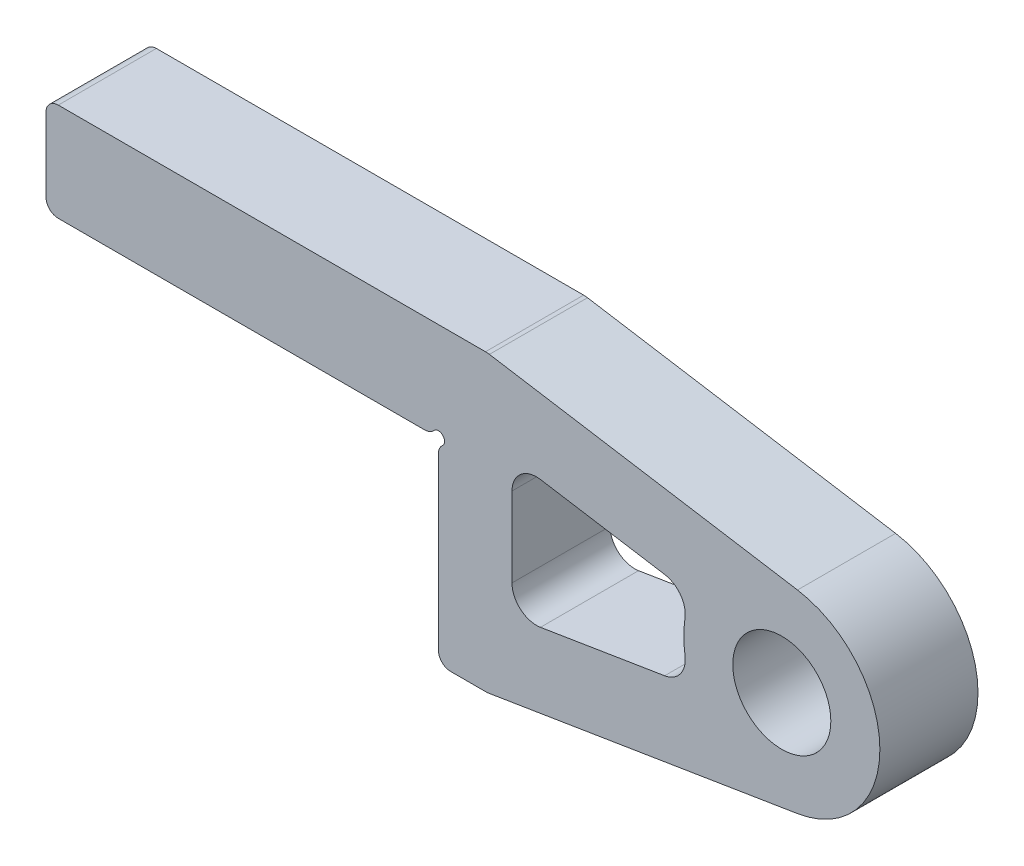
ISO-10303-21;
HEADER;
FILE_DESCRIPTION(('STEP AP214'),'2;1');
FILE_NAME('part.step','',(''),(''),'','','');
FILE_SCHEMA(('AUTOMOTIVE_DESIGN { 1 0 10303 214 1 1 1 1 }'));
ENDSEC;
DATA;
#1=APPLICATION_CONTEXT('core data for automotive mechanical design processes');
#2=APPLICATION_PROTOCOL_DEFINITION('international standard','automotive_design',2000,#1);
#3=PRODUCT_CONTEXT('',#1,'mechanical');
#4=PRODUCT('Part','Part','',(#3));
#5=PRODUCT_RELATED_PRODUCT_CATEGORY('part','',(#4));
#6=PRODUCT_DEFINITION_FORMATION('','',#4);
#7=PRODUCT_DEFINITION_CONTEXT('part definition',#1,'design');
#8=PRODUCT_DEFINITION('design','',#6,#7);
#9=PRODUCT_DEFINITION_SHAPE('','',#8);
#10=(LENGTH_UNIT() NAMED_UNIT(*) SI_UNIT(.MILLI.,.METRE.));
#11=(NAMED_UNIT(*) PLANE_ANGLE_UNIT() SI_UNIT($,.RADIAN.));
#12=(NAMED_UNIT(*) SI_UNIT($,.STERADIAN.) SOLID_ANGLE_UNIT());
#13=UNCERTAINTY_MEASURE_WITH_UNIT(LENGTH_MEASURE(1.E-05),#10,'distance_accuracy_value','');
#14=(GEOMETRIC_REPRESENTATION_CONTEXT(3) GLOBAL_UNCERTAINTY_ASSIGNED_CONTEXT((#13)) GLOBAL_UNIT_ASSIGNED_CONTEXT((#10,
#11,#12)) REPRESENTATION_CONTEXT('',''));
#15=CARTESIAN_POINT('',(0.,0.,0.));
#16=DIRECTION('',(0.,0.,1.));
#17=DIRECTION('',(1.,0.,0.));
#18=AXIS2_PLACEMENT_3D('',#15,#16,#17);
#19=CARTESIAN_POINT('',(0.,0.,6.35));
#20=DIRECTION('',(0.,0.,-1.));
#21=DIRECTION('',(-1.,0.,0.));
#22=AXIS2_PLACEMENT_3D('',#19,#20,#21);
#23=PLANE('',#22);
#24=DIRECTION('',(1.,0.,0.));
#25=VECTOR('',#24,1.);
#26=CARTESIAN_POINT('',(-25.4,-6.35,6.35));
#27=LINE('',#26,#25);
#28=CARTESIAN_POINT('',(-23.8125,-6.35,6.35));
#29=VERTEX_POINT('',#28);
#30=CARTESIAN_POINT('',(23.6251210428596,-6.35,6.35));
#31=VERTEX_POINT('',#30);
#32=EDGE_CURVE('E415',#29,#31,#27,.T.);
#33=ORIENTED_EDGE('',*,*,#32,.T.);
#34=CARTESIAN_POINT('',(23.6251210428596,-4.7625,6.35));
#35=DIRECTION('',(0.,0.,-1.));
#36=DIRECTION('',(-1.,0.,0.));
#37=AXIS2_PLACEMENT_3D('',#34,#35,#36);
#38=CIRCLE('',#37,1.5875);
#39=CARTESIAN_POINT('',(24.8083736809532,-5.82083333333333,6.35));
#40=VERTEX_POINT('',#39);
#41=EDGE_CURVE('E484',#31,#40,#38,.F.);
#42=ORIENTED_EDGE('',*,*,#41,.T.);
#43=CARTESIAN_POINT('',(25.4,-6.35,6.35));
#44=DIRECTION('',(0.,0.,1.));
#45=DIRECTION('',(1.,0.,0.));
#46=AXIS2_PLACEMENT_3D('',#43,#44,#45);
#47=CIRCLE('',#46,0.79375);
#48=CARTESIAN_POINT('',(25.9291666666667,-6.94162631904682,6.35));
#49=VERTEX_POINT('',#48);
#50=EDGE_CURVE('E309',#49,#40,#47,.T.);
#51=ORIENTED_EDGE('',*,*,#50,.F.);
#52=CARTESIAN_POINT('',(26.9875,-8.12487895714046,6.35));
#53=DIRECTION('',(0.,0.,-1.));
#54=DIRECTION('',(-1.,0.,0.));
#55=AXIS2_PLACEMENT_3D('',#52,#53,#54);
#56=CIRCLE('',#55,1.5875);
#57=CARTESIAN_POINT('',(25.4,-8.12487895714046,6.35));
#58=VERTEX_POINT('',#57);
#59=EDGE_CURVE('E482',#49,#58,#56,.F.);
#60=ORIENTED_EDGE('',*,*,#59,.T.);
#61=DIRECTION('',(0.,-1.,0.));
#62=VECTOR('',#61,1.);
#63=CARTESIAN_POINT('',(25.4,-6.35,6.35));
#64=LINE('',#63,#62);
#65=CARTESIAN_POINT('',(25.4,-30.1625,6.35));
#66=VERTEX_POINT('',#65);
#67=EDGE_CURVE('E418',#58,#66,#64,.T.);
#68=ORIENTED_EDGE('',*,*,#67,.T.);
#69=CARTESIAN_POINT('',(26.9875,-30.1625,6.35));
#70=DIRECTION('',(0.,0.,-1.));
#71=DIRECTION('',(-1.,0.,0.));
#72=AXIS2_PLACEMENT_3D('',#69,#70,#71);
#73=CIRCLE('',#72,1.5875);
#74=CARTESIAN_POINT('',(26.9875,-31.75,6.35));
#75=VERTEX_POINT('',#74);
#76=EDGE_CURVE('E467',#66,#75,#73,.F.);
#77=ORIENTED_EDGE('',*,*,#76,.T.);
#78=DIRECTION('',(1.,0.,0.));
#79=VECTOR('',#78,1.);
#80=CARTESIAN_POINT('',(25.4,-31.75,6.35));
#81=LINE('',#80,#79);
#82=CARTESIAN_POINT('',(31.4940161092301,-31.75,6.35));
#83=VERTEX_POINT('',#82);
#84=EDGE_CURVE('E420',#75,#83,#81,.T.);
#85=ORIENTED_EDGE('',*,*,#84,.T.);
#86=CARTESIAN_POINT('',(31.4940161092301,-28.575,6.35));
#87=DIRECTION('',(0.,0.,1.));
#88=DIRECTION('',(1.,0.,0.));
#89=AXIS2_PLACEMENT_3D('',#86,#87,#88);
#90=CIRCLE('',#89,3.175);
#91=CARTESIAN_POINT('',(32.0026774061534,-31.7089892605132,6.35));
#92=VERTEX_POINT('',#91);
#93=EDGE_CURVE('E348',#83,#92,#90,.T.);
#94=ORIENTED_EDGE('',*,*,#93,.T.);
#95=DIRECTION('',(0.987083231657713,0.160208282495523,0.));
#96=VECTOR('',#95,1.);
#97=CARTESIAN_POINT('',(5.83582789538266,-35.9559928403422,6.35));
#98=LINE('',#97,#96);
#99=CARTESIAN_POINT('',(71.8846451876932,-25.235957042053,6.35));
#100=VERTEX_POINT('',#99);
#101=EDGE_CURVE('E366',#92,#100,#98,.T.);
#102=ORIENTED_EDGE('',*,*,#101,.T.);
#103=CARTESIAN_POINT('',(69.85,-12.7,6.35));
#104=DIRECTION('',(0.,0.,1.));
#105=DIRECTION('',(1.,0.,0.));
#106=AXIS2_PLACEMENT_3D('',#103,#104,#105);
#107=CIRCLE('',#106,12.7);
#108=CARTESIAN_POINT('',(71.8846451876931,-0.164042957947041,6.35));
#109=VERTEX_POINT('',#108);
#110=EDGE_CURVE('E363',#100,#109,#107,.T.);
#111=ORIENTED_EDGE('',*,*,#110,.T.);
#112=DIRECTION('',(0.987083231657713,-0.160208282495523,0.));
#113=VECTOR('',#112,1.);
#114=CARTESIAN_POINT('',(1.81909960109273,11.2079268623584,6.35));
#115=LINE('',#114,#113);
#116=CARTESIAN_POINT('',(32.0026774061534,6.30898926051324,6.35));
#117=VERTEX_POINT('',#116);
#118=EDGE_CURVE('E360',#117,#109,#115,.T.);
#119=ORIENTED_EDGE('',*,*,#118,.F.);
#120=CARTESIAN_POINT('',(31.4940161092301,3.175,6.35));
#121=DIRECTION('',(0.,0.,1.));
#122=DIRECTION('',(1.,0.,0.));
#123=AXIS2_PLACEMENT_3D('',#120,#121,#122);
#124=CIRCLE('',#123,3.175);
#125=CARTESIAN_POINT('',(31.4940161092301,6.35,6.35));
#126=VERTEX_POINT('',#125);
#127=EDGE_CURVE('E341',#126,#117,#124,.F.);
#128=ORIENTED_EDGE('',*,*,#127,.F.);
#129=DIRECTION('',(-1.,0.,0.));
#130=VECTOR('',#129,1.);
#131=CARTESIAN_POINT('',(25.4,6.35,6.35));
#132=LINE('',#131,#130);
#133=CARTESIAN_POINT('',(-23.8125,6.35,6.35));
#134=VERTEX_POINT('',#133);
#135=EDGE_CURVE('E408',#126,#134,#132,.T.);
#136=ORIENTED_EDGE('',*,*,#135,.T.);
#137=CARTESIAN_POINT('',(-23.8125,4.7625,6.35));
#138=DIRECTION('',(0.,0.,-1.));
#139=DIRECTION('',(-1.,0.,0.));
#140=AXIS2_PLACEMENT_3D('',#137,#138,#139);
#141=CIRCLE('',#140,1.5875);
#142=CARTESIAN_POINT('',(-25.4,4.7625,6.35));
#143=VERTEX_POINT('',#142);
#144=EDGE_CURVE('E463',#134,#143,#141,.F.);
#145=ORIENTED_EDGE('',*,*,#144,.T.);
#146=DIRECTION('',(0.,-1.,0.));
#147=VECTOR('',#146,1.);
#148=CARTESIAN_POINT('',(-25.4,-6.35,6.35));
#149=LINE('',#148,#147);
#150=CARTESIAN_POINT('',(-25.4,-4.7625,6.35));
#151=VERTEX_POINT('',#150);
#152=EDGE_CURVE('E411',#143,#151,#149,.T.);
#153=ORIENTED_EDGE('',*,*,#152,.T.);
#154=CARTESIAN_POINT('',(-23.8125,-4.7625,6.35));
#155=DIRECTION('',(0.,0.,-1.));
#156=DIRECTION('',(-1.,0.,0.));
#157=AXIS2_PLACEMENT_3D('',#154,#155,#156);
#158=CIRCLE('',#157,1.5875);
#159=EDGE_CURVE('E465',#151,#29,#158,.F.);
#160=ORIENTED_EDGE('',*,*,#159,.T.);
#161=EDGE_LOOP('',(#33,#42,#51,#60,#68,#77,#85,#94,#102,#111,#119,#128,#136,#145,#153,#160));
#162=FACE_BOUND('',#161,.T.);
#163=CARTESIAN_POINT('',(69.85,-12.7,6.35));
#164=DIRECTION('',(0.,0.,1.));
#165=DIRECTION('',(1.,0.,0.));
#166=AXIS2_PLACEMENT_3D('',#163,#164,#165);
#167=CIRCLE('',#166,6.35);
#168=CARTESIAN_POINT('',(76.2,-12.7,6.35));
#169=VERTEX_POINT('',#168);
#170=EDGE_CURVE('E334',#169,#169,#167,.T.);
#171=ORIENTED_EDGE('',*,*,#170,.F.);
#172=EDGE_LOOP('',(#171));
#173=FACE_BOUND('',#172,.T.);
#174=CARTESIAN_POINT('',(38.1,-17.8531753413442,6.35));
#175=DIRECTION('',(0.,0.,1.));
#176=DIRECTION('',(1.,0.,0.));
#177=AXIS2_PLACEMENT_3D('',#174,#175,#176);
#178=CIRCLE('',#177,3.175);
#179=CARTESIAN_POINT('',(38.6086612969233,-20.9871646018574,6.35));
#180=VERTEX_POINT('',#179);
#181=CARTESIAN_POINT('',(34.925,-17.8531753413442,6.35));
#182=VERTEX_POINT('',#181);
#183=EDGE_CURVE('E283',#180,#182,#178,.F.);
#184=ORIENTED_EDGE('',*,*,#183,.T.);
#185=DIRECTION('',(0.,-1.,0.));
#186=VECTOR('',#185,1.);
#187=CARTESIAN_POINT('',(34.925,0.,6.35));
#188=LINE('',#187,#186);
#189=CARTESIAN_POINT('',(34.925,-7.54682465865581,6.35));
#190=VERTEX_POINT('',#189);
#191=EDGE_CURVE('E303',#190,#182,#188,.T.);
#192=ORIENTED_EDGE('',*,*,#191,.F.);
#193=CARTESIAN_POINT('',(38.1,-7.54682465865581,6.35));
#194=DIRECTION('',(0.,0.,1.));
#195=DIRECTION('',(1.,0.,0.));
#196=AXIS2_PLACEMENT_3D('',#193,#194,#195);
#197=CIRCLE('',#196,3.175);
#198=CARTESIAN_POINT('',(38.6086612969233,-4.41283539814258,6.35));
#199=VERTEX_POINT('',#198);
#200=EDGE_CURVE('E306',#199,#190,#197,.T.);
#201=ORIENTED_EDGE('',*,*,#200,.F.);
#202=DIRECTION('',(0.987083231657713,-0.160208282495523,0.));
#203=VECTOR('',#202,1.);
#204=CARTESIAN_POINT('',(0.293115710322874,1.80595908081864,6.35));
#205=LINE('',#204,#203);
#206=CARTESIAN_POINT('',(54.6887149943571,-7.02270425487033,6.35));
#207=VERTEX_POINT('',#206);
#208=EDGE_CURVE('E327',#199,#207,#205,.T.);
#209=ORIENTED_EDGE('',*,*,#208,.T.);
#210=CARTESIAN_POINT('',(54.1800536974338,-10.1566935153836,6.35));
#211=DIRECTION('',(0.,0.,-1.));
#212=DIRECTION('',(-1.,0.,0.));
#213=AXIS2_PLACEMENT_3D('',#210,#211,#212);
#214=CIRCLE('',#213,3.175);
#215=CARTESIAN_POINT('',(57.314042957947,-10.6653548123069,6.35));
#216=VERTEX_POINT('',#215);
#217=EDGE_CURVE('E446',#207,#216,#214,.T.);
#218=ORIENTED_EDGE('',*,*,#217,.T.);
#219=CARTESIAN_POINT('',(69.85,-12.7,6.35));
#220=DIRECTION('',(0.,0.,1.));
#221=DIRECTION('',(1.,0.,0.));
#222=AXIS2_PLACEMENT_3D('',#219,#220,#221);
#223=CIRCLE('',#222,12.7);
#224=CARTESIAN_POINT('',(57.314042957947,-14.7346451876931,6.35));
#225=VERTEX_POINT('',#224);
#226=EDGE_CURVE('E324',#216,#225,#223,.T.);
#227=ORIENTED_EDGE('',*,*,#226,.T.);
#228=CARTESIAN_POINT('',(54.1800536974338,-15.2433064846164,6.35));
#229=DIRECTION('',(0.,0.,-1.));
#230=DIRECTION('',(-1.,0.,0.));
#231=AXIS2_PLACEMENT_3D('',#228,#229,#230);
#232=CIRCLE('',#231,3.175);
#233=CARTESIAN_POINT('',(54.6887149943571,-18.3772957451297,6.35));
#234=VERTEX_POINT('',#233);
#235=EDGE_CURVE('E442',#225,#234,#232,.T.);
#236=ORIENTED_EDGE('',*,*,#235,.T.);
#237=DIRECTION('',(0.987083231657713,0.160208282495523,0.));
#238=VECTOR('',#237,1.);
#239=CARTESIAN_POINT('',(4.3098440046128,-26.5540250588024,6.35));
#240=LINE('',#239,#238);
#241=EDGE_CURVE('E321',#180,#234,#240,.T.);
#242=ORIENTED_EDGE('',*,*,#241,.F.);
#243=EDGE_LOOP('',(#184,#192,#201,#209,#218,#227,#236,#242));
#244=FACE_BOUND('',#243,.T.);
#245=ADVANCED_FACE('F108',(#162,#173,#244),#23,.F.);
#246=CARTESIAN_POINT('',(0.,0.,-6.35));
#247=DIRECTION('',(0.,0.,-1.));
#248=DIRECTION('',(-1.,0.,0.));
#249=AXIS2_PLACEMENT_3D('',#246,#247,#248);
#250=PLANE('',#249);
#251=CARTESIAN_POINT('',(25.4,-6.35,-6.35));
#252=DIRECTION('',(0.,0.,1.));
#253=DIRECTION('',(1.,0.,0.));
#254=AXIS2_PLACEMENT_3D('',#251,#252,#253);
#255=CIRCLE('',#254,0.79375);
#256=CARTESIAN_POINT('',(25.9291666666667,-6.94162631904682,-6.35));
#257=VERTEX_POINT('',#256);
#258=CARTESIAN_POINT('',(24.8083736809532,-5.82083333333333,-6.35));
#259=VERTEX_POINT('',#258);
#260=EDGE_CURVE('E322',#257,#259,#255,.T.);
#261=ORIENTED_EDGE('',*,*,#260,.T.);
#262=CARTESIAN_POINT('',(23.6251210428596,-4.7625,-6.35));
#263=DIRECTION('',(0.,0.,-1.));
#264=DIRECTION('',(-1.,0.,0.));
#265=AXIS2_PLACEMENT_3D('',#262,#263,#264);
#266=CIRCLE('',#265,1.5875);
#267=CARTESIAN_POINT('',(23.6251210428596,-6.35,-6.35));
#268=VERTEX_POINT('',#267);
#269=EDGE_CURVE('E116',#259,#268,#266,.T.);
#270=ORIENTED_EDGE('',*,*,#269,.T.);
#271=DIRECTION('',(1.,0.,0.));
#272=VECTOR('',#271,1.);
#273=CARTESIAN_POINT('',(-25.4,-6.35,-6.35));
#274=LINE('',#273,#272);
#275=CARTESIAN_POINT('',(-23.8125,-6.35,-6.35));
#276=VERTEX_POINT('',#275);
#277=EDGE_CURVE('E428',#276,#268,#274,.T.);
#278=ORIENTED_EDGE('',*,*,#277,.F.);
#279=CARTESIAN_POINT('',(-23.8125,-4.7625,-6.35));
#280=DIRECTION('',(0.,0.,-1.));
#281=DIRECTION('',(-1.,0.,0.));
#282=AXIS2_PLACEMENT_3D('',#279,#280,#281);
#283=CIRCLE('',#282,1.5875);
#284=CARTESIAN_POINT('',(-25.4,-4.7625,-6.35));
#285=VERTEX_POINT('',#284);
#286=EDGE_CURVE('E455',#276,#285,#283,.T.);
#287=ORIENTED_EDGE('',*,*,#286,.T.);
#288=DIRECTION('',(0.,-1.,0.));
#289=VECTOR('',#288,1.);
#290=CARTESIAN_POINT('',(-25.4,-6.35,-6.35));
#291=LINE('',#290,#289);
#292=CARTESIAN_POINT('',(-25.4,4.7625,-6.35));
#293=VERTEX_POINT('',#292);
#294=EDGE_CURVE('E425',#293,#285,#291,.T.);
#295=ORIENTED_EDGE('',*,*,#294,.F.);
#296=CARTESIAN_POINT('',(-23.8125,4.7625,-6.35));
#297=DIRECTION('',(0.,0.,-1.));
#298=DIRECTION('',(-1.,0.,0.));
#299=AXIS2_PLACEMENT_3D('',#296,#297,#298);
#300=CIRCLE('',#299,1.5875);
#301=CARTESIAN_POINT('',(-23.8125,6.35,-6.35));
#302=VERTEX_POINT('',#301);
#303=EDGE_CURVE('E453',#293,#302,#300,.T.);
#304=ORIENTED_EDGE('',*,*,#303,.T.);
#305=DIRECTION('',(-1.,0.,0.));
#306=VECTOR('',#305,1.);
#307=CARTESIAN_POINT('',(-25.4,6.35,-6.35));
#308=LINE('',#307,#306);
#309=CARTESIAN_POINT('',(31.4940161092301,6.35,-6.35));
#310=VERTEX_POINT('',#309);
#311=EDGE_CURVE('E407',#310,#302,#308,.T.);
#312=ORIENTED_EDGE('',*,*,#311,.F.);
#313=CARTESIAN_POINT('',(31.4940161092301,3.175,-6.35));
#314=DIRECTION('',(0.,0.,1.));
#315=DIRECTION('',(1.,0.,0.));
#316=AXIS2_PLACEMENT_3D('',#313,#314,#315);
#317=CIRCLE('',#316,3.175);
#318=CARTESIAN_POINT('',(32.0026774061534,6.30898926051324,-6.35));
#319=VERTEX_POINT('',#318);
#320=EDGE_CURVE('E344',#310,#319,#317,.F.);
#321=ORIENTED_EDGE('',*,*,#320,.T.);
#322=DIRECTION('',(0.987083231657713,-0.160208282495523,0.));
#323=VECTOR('',#322,1.);
#324=CARTESIAN_POINT('',(1.81909960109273,11.2079268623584,-6.35));
#325=LINE('',#324,#323);
#326=CARTESIAN_POINT('',(71.8846451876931,-0.164042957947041,-6.35));
#327=VERTEX_POINT('',#326);
#328=EDGE_CURVE('E347',#319,#327,#325,.T.);
#329=ORIENTED_EDGE('',*,*,#328,.T.);
#330=CARTESIAN_POINT('',(69.85,-12.7,-6.35));
#331=DIRECTION('',(0.,0.,1.));
#332=DIRECTION('',(1.,0.,0.));
#333=AXIS2_PLACEMENT_3D('',#330,#331,#332);
#334=CIRCLE('',#333,12.7);
#335=CARTESIAN_POINT('',(71.8846451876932,-25.235957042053,-6.35));
#336=VERTEX_POINT('',#335);
#337=EDGE_CURVE('E351',#336,#327,#334,.T.);
#338=ORIENTED_EDGE('',*,*,#337,.F.);
#339=DIRECTION('',(0.987083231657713,0.160208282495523,0.));
#340=VECTOR('',#339,1.);
#341=CARTESIAN_POINT('',(5.83582789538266,-35.9559928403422,-6.35));
#342=LINE('',#341,#340);
#343=CARTESIAN_POINT('',(32.0026774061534,-31.7089892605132,-6.35));
#344=VERTEX_POINT('',#343);
#345=EDGE_CURVE('E353',#344,#336,#342,.T.);
#346=ORIENTED_EDGE('',*,*,#345,.F.);
#347=CARTESIAN_POINT('',(31.4940161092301,-28.575,-6.35));
#348=DIRECTION('',(0.,0.,1.));
#349=DIRECTION('',(1.,0.,0.));
#350=AXIS2_PLACEMENT_3D('',#347,#348,#349);
#351=CIRCLE('',#350,3.175);
#352=CARTESIAN_POINT('',(31.4940161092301,-31.75,-6.35));
#353=VERTEX_POINT('',#352);
#354=EDGE_CURVE('E355',#353,#344,#351,.T.);
#355=ORIENTED_EDGE('',*,*,#354,.F.);
#356=DIRECTION('',(1.,0.,0.));
#357=VECTOR('',#356,1.);
#358=CARTESIAN_POINT('',(25.4,-31.75,-6.35));
#359=LINE('',#358,#357);
#360=CARTESIAN_POINT('',(26.9875,-31.75,-6.35));
#361=VERTEX_POINT('',#360);
#362=EDGE_CURVE('E412',#361,#353,#359,.T.);
#363=ORIENTED_EDGE('',*,*,#362,.F.);
#364=CARTESIAN_POINT('',(26.9875,-30.1625,-6.35));
#365=DIRECTION('',(0.,0.,-1.));
#366=DIRECTION('',(-1.,0.,0.));
#367=AXIS2_PLACEMENT_3D('',#364,#365,#366);
#368=CIRCLE('',#367,1.5875);
#369=CARTESIAN_POINT('',(25.4,-30.1625,-6.35));
#370=VERTEX_POINT('',#369);
#371=EDGE_CURVE('E457',#361,#370,#368,.T.);
#372=ORIENTED_EDGE('',*,*,#371,.T.);
#373=DIRECTION('',(0.,-1.,0.));
#374=VECTOR('',#373,1.);
#375=CARTESIAN_POINT('',(25.4,-6.35,-6.35));
#376=LINE('',#375,#374);
#377=CARTESIAN_POINT('',(25.4,-8.12487895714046,-6.35));
#378=VERTEX_POINT('',#377);
#379=EDGE_CURVE('E431',#378,#370,#376,.T.);
#380=ORIENTED_EDGE('',*,*,#379,.F.);
#381=CARTESIAN_POINT('',(26.9875,-8.12487895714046,-6.35));
#382=DIRECTION('',(0.,0.,-1.));
#383=DIRECTION('',(-1.,0.,0.));
#384=AXIS2_PLACEMENT_3D('',#381,#382,#383);
#385=CIRCLE('',#384,1.5875);
#386=EDGE_CURVE('E123',#378,#257,#385,.T.);
#387=ORIENTED_EDGE('',*,*,#386,.T.);
#388=EDGE_LOOP('',(#261,#270,#278,#287,#295,#304,#312,#321,#329,#338,#346,#355,#363,#372,#380,#387));
#389=FACE_BOUND('',#388,.T.);
#390=CARTESIAN_POINT('',(69.85,-12.7,-6.35));
#391=DIRECTION('',(0.,0.,1.));
#392=DIRECTION('',(1.,0.,0.));
#393=AXIS2_PLACEMENT_3D('',#390,#391,#392);
#394=CIRCLE('',#393,6.35);
#395=CARTESIAN_POINT('',(76.2,-12.7,-6.35));
#396=VERTEX_POINT('',#395);
#397=EDGE_CURVE('E338',#396,#396,#394,.T.);
#398=ORIENTED_EDGE('',*,*,#397,.T.);
#399=EDGE_LOOP('',(#398));
#400=FACE_BOUND('',#399,.T.);
#401=DIRECTION('',(0.,-1.,0.));
#402=VECTOR('',#401,1.);
#403=CARTESIAN_POINT('',(34.925,0.,-6.35));
#404=LINE('',#403,#402);
#405=CARTESIAN_POINT('',(34.925,-7.54682465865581,-6.35));
#406=VERTEX_POINT('',#405);
#407=CARTESIAN_POINT('',(34.925,-17.8531753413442,-6.35));
#408=VERTEX_POINT('',#407);
#409=EDGE_CURVE('E288',#406,#408,#404,.T.);
#410=ORIENTED_EDGE('',*,*,#409,.T.);
#411=CARTESIAN_POINT('',(38.1,-17.8531753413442,-6.35));
#412=DIRECTION('',(0.,0.,1.));
#413=DIRECTION('',(1.,0.,0.));
#414=AXIS2_PLACEMENT_3D('',#411,#412,#413);
#415=CIRCLE('',#414,3.175);
#416=CARTESIAN_POINT('',(38.6086612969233,-20.9871646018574,-6.35));
#417=VERTEX_POINT('',#416);
#418=EDGE_CURVE('E280',#417,#408,#415,.F.);
#419=ORIENTED_EDGE('',*,*,#418,.F.);
#420=DIRECTION('',(0.987083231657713,0.160208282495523,0.));
#421=VECTOR('',#420,1.);
#422=CARTESIAN_POINT('',(4.3098440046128,-26.5540250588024,-6.35));
#423=LINE('',#422,#421);
#424=CARTESIAN_POINT('',(54.6887149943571,-18.3772957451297,-6.35));
#425=VERTEX_POINT('',#424);
#426=EDGE_CURVE('E291',#417,#425,#423,.T.);
#427=ORIENTED_EDGE('',*,*,#426,.T.);
#428=CARTESIAN_POINT('',(54.1800536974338,-15.2433064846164,-6.35));
#429=DIRECTION('',(0.,0.,-1.));
#430=DIRECTION('',(-1.,0.,0.));
#431=AXIS2_PLACEMENT_3D('',#428,#429,#430);
#432=CIRCLE('',#431,3.175);
#433=CARTESIAN_POINT('',(57.314042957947,-14.7346451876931,-6.35));
#434=VERTEX_POINT('',#433);
#435=EDGE_CURVE('E444',#425,#434,#432,.F.);
#436=ORIENTED_EDGE('',*,*,#435,.T.);
#437=CARTESIAN_POINT('',(69.85,-12.7,-6.35));
#438=DIRECTION('',(0.,0.,1.));
#439=DIRECTION('',(1.,0.,0.));
#440=AXIS2_PLACEMENT_3D('',#437,#438,#439);
#441=CIRCLE('',#440,12.7);
#442=CARTESIAN_POINT('',(57.314042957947,-10.6653548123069,-6.35));
#443=VERTEX_POINT('',#442);
#444=EDGE_CURVE('E297',#443,#434,#441,.T.);
#445=ORIENTED_EDGE('',*,*,#444,.F.);
#446=CARTESIAN_POINT('',(54.1800536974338,-10.1566935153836,-6.35));
#447=DIRECTION('',(0.,0.,-1.));
#448=DIRECTION('',(-1.,0.,0.));
#449=AXIS2_PLACEMENT_3D('',#446,#447,#448);
#450=CIRCLE('',#449,3.175);
#451=CARTESIAN_POINT('',(54.6887149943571,-7.02270425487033,-6.35));
#452=VERTEX_POINT('',#451);
#453=EDGE_CURVE('E448',#443,#452,#450,.F.);
#454=ORIENTED_EDGE('',*,*,#453,.T.);
#455=DIRECTION('',(0.987083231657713,-0.160208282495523,0.));
#456=VECTOR('',#455,1.);
#457=CARTESIAN_POINT('',(0.293115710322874,1.80595908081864,-6.35));
#458=LINE('',#457,#456);
#459=CARTESIAN_POINT('',(38.6086612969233,-4.41283539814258,-6.35));
#460=VERTEX_POINT('',#459);
#461=EDGE_CURVE('E314',#460,#452,#458,.T.);
#462=ORIENTED_EDGE('',*,*,#461,.F.);
#463=CARTESIAN_POINT('',(38.1,-7.54682465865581,-6.35));
#464=DIRECTION('',(0.,0.,1.));
#465=DIRECTION('',(1.,0.,0.));
#466=AXIS2_PLACEMENT_3D('',#463,#464,#465);
#467=CIRCLE('',#466,3.175);
#468=EDGE_CURVE('E317',#460,#406,#467,.T.);
#469=ORIENTED_EDGE('',*,*,#468,.T.);
#470=EDGE_LOOP('',(#410,#419,#427,#436,#445,#454,#462,#469));
#471=FACE_BOUND('',#470,.T.);
#472=ADVANCED_FACE('F300',(#389,#400,#471),#250,.T.);
#473=CARTESIAN_POINT('',(-25.4,6.35,6.35));
#474=DIRECTION('',(0.,-1.,0.));
#475=DIRECTION('',(0.,0.,-1.));
#476=AXIS2_PLACEMENT_3D('',#473,#474,#475);
#477=PLANE('',#476);
#478=ORIENTED_EDGE('',*,*,#311,.T.);
#479=DIRECTION('',(0.,0.,-1.));
#480=VECTOR('',#479,1.);
#481=CARTESIAN_POINT('',(-23.8125,6.35,6.35));
#482=LINE('',#481,#480);
#483=EDGE_CURVE('E477',#302,#134,#482,.F.);
#484=ORIENTED_EDGE('',*,*,#483,.T.);
#485=ORIENTED_EDGE('',*,*,#135,.F.);
#486=DIRECTION('',(0.,0.,1.));
#487=VECTOR('',#486,1.);
#488=CARTESIAN_POINT('',(31.4940161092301,6.35,-6.35));
#489=LINE('',#488,#487);
#490=EDGE_CURVE('E357',#310,#126,#489,.T.);
#491=ORIENTED_EDGE('',*,*,#490,.F.);
#492=EDGE_LOOP('',(#478,#484,#485,#491));
#493=FACE_BOUND('',#492,.T.);
#494=ADVANCED_FACE('F545',(#493),#477,.F.);
#495=CARTESIAN_POINT('',(-25.4,-6.35,6.35));
#496=DIRECTION('',(1.,0.,0.));
#497=DIRECTION('',(0.,0.,-1.));
#498=AXIS2_PLACEMENT_3D('',#495,#496,#497);
#499=PLANE('',#498);
#500=ORIENTED_EDGE('',*,*,#294,.T.);
#501=DIRECTION('',(0.,0.,-1.));
#502=VECTOR('',#501,1.);
#503=CARTESIAN_POINT('',(-25.4,-4.7625,6.35));
#504=LINE('',#503,#502);
#505=EDGE_CURVE('E475',#285,#151,#504,.F.);
#506=ORIENTED_EDGE('',*,*,#505,.T.);
#507=ORIENTED_EDGE('',*,*,#152,.F.);
#508=DIRECTION('',(0.,0.,-1.));
#509=VECTOR('',#508,1.);
#510=CARTESIAN_POINT('',(-25.4,4.7625,6.35));
#511=LINE('',#510,#509);
#512=EDGE_CURVE('E472',#143,#293,#511,.T.);
#513=ORIENTED_EDGE('',*,*,#512,.T.);
#514=EDGE_LOOP('',(#500,#506,#507,#513));
#515=FACE_BOUND('',#514,.T.);
#516=ADVANCED_FACE('F554',(#515),#499,.F.);
#517=CARTESIAN_POINT('',(-25.4,-6.35,6.35));
#518=DIRECTION('',(0.,1.,0.));
#519=DIRECTION('',(0.,0.,1.));
#520=AXIS2_PLACEMENT_3D('',#517,#518,#519);
#521=PLANE('',#520);
#522=CARTESIAN_POINT('',(-12.7,-6.35,0.));
#523=DIRECTION('',(0.,-1.,0.));
#524=DIRECTION('',(0.,0.,-1.));
#525=AXIS2_PLACEMENT_3D('',#522,#523,#524);
#526=CIRCLE('',#525,2.79399999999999);
#527=CARTESIAN_POINT('',(-12.7,-6.35,-2.79399999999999));
#528=VERTEX_POINT('',#527);
#529=EDGE_CURVE('E374',#528,#528,#526,.T.);
#530=ORIENTED_EDGE('',*,*,#529,.F.);
#531=EDGE_LOOP('',(#530));
#532=FACE_BOUND('',#531,.T.);
#533=CARTESIAN_POINT('',(12.7,-6.35,0.));
#534=DIRECTION('',(0.,-1.,0.));
#535=DIRECTION('',(0.,0.,-1.));
#536=AXIS2_PLACEMENT_3D('',#533,#534,#535);
#537=CIRCLE('',#536,2.79399999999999);
#538=CARTESIAN_POINT('',(12.7,-6.35,-2.79399999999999));
#539=VERTEX_POINT('',#538);
#540=EDGE_CURVE('E395',#539,#539,#537,.T.);
#541=ORIENTED_EDGE('',*,*,#540,.F.);
#542=EDGE_LOOP('',(#541));
#543=FACE_BOUND('',#542,.T.);
#544=ORIENTED_EDGE('',*,*,#277,.T.);
#545=DIRECTION('',(0.,0.,1.));
#546=VECTOR('',#545,1.);
#547=CARTESIAN_POINT('',(23.6251210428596,-6.35,6.35));
#548=LINE('',#547,#546);
#549=EDGE_CURVE('E479',#268,#31,#548,.T.);
#550=ORIENTED_EDGE('',*,*,#549,.T.);
#551=ORIENTED_EDGE('',*,*,#32,.F.);
#552=DIRECTION('',(0.,0.,-1.));
#553=VECTOR('',#552,1.);
#554=CARTESIAN_POINT('',(-23.8125,-6.35,6.35));
#555=LINE('',#554,#553);
#556=EDGE_CURVE('E469',#29,#276,#555,.T.);
#557=ORIENTED_EDGE('',*,*,#556,.T.);
#558=EDGE_LOOP('',(#544,#550,#551,#557));
#559=FACE_BOUND('',#558,.T.);
#560=ADVANCED_FACE('F496',(#532,#543,#559),#521,.F.);
#561=CARTESIAN_POINT('',(25.4,-6.35,6.35));
#562=DIRECTION('',(1.,0.,0.));
#563=DIRECTION('',(0.,1.,0.));
#564=AXIS2_PLACEMENT_3D('',#561,#562,#563);
#565=PLANE('',#564);
#566=ORIENTED_EDGE('',*,*,#67,.F.);
#567=DIRECTION('',(0.,0.,1.));
#568=VECTOR('',#567,1.);
#569=CARTESIAN_POINT('',(25.4,-8.12487895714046,6.35));
#570=LINE('',#569,#568);
#571=EDGE_CURVE('E12',#58,#378,#570,.F.);
#572=ORIENTED_EDGE('',*,*,#571,.T.);
#573=ORIENTED_EDGE('',*,*,#379,.T.);
#574=DIRECTION('',(0.,0.,-1.));
#575=VECTOR('',#574,1.);
#576=CARTESIAN_POINT('',(25.4,-30.1625,6.35));
#577=LINE('',#576,#575);
#578=EDGE_CURVE('E460',#370,#66,#577,.F.);
#579=ORIENTED_EDGE('',*,*,#578,.T.);
#580=EDGE_LOOP('',(#566,#572,#573,#579));
#581=FACE_BOUND('',#580,.T.);
#582=ADVANCED_FACE('F507',(#581),#565,.F.);
#583=CARTESIAN_POINT('',(25.4,-31.75,6.35));
#584=DIRECTION('',(0.,1.,0.));
#585=DIRECTION('',(-1.,0.,0.));
#586=AXIS2_PLACEMENT_3D('',#583,#584,#585);
#587=PLANE('',#586);
#588=ORIENTED_EDGE('',*,*,#84,.F.);
#589=DIRECTION('',(0.,0.,-1.));
#590=VECTOR('',#589,1.);
#591=CARTESIAN_POINT('',(26.9875,-31.75,6.35));
#592=LINE('',#591,#590);
#593=EDGE_CURVE('E450',#75,#361,#592,.T.);
#594=ORIENTED_EDGE('',*,*,#593,.T.);
#595=ORIENTED_EDGE('',*,*,#362,.T.);
#596=DIRECTION('',(0.,0.,1.));
#597=VECTOR('',#596,1.);
#598=CARTESIAN_POINT('',(31.4940161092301,-31.75,-6.35));
#599=LINE('',#598,#597);
#600=EDGE_CURVE('E371',#353,#83,#599,.T.);
#601=ORIENTED_EDGE('',*,*,#600,.T.);
#602=EDGE_LOOP('',(#588,#594,#595,#601));
#603=FACE_BOUND('',#602,.T.);
#604=ADVANCED_FACE('F517',(#603),#587,.F.);
#605=CARTESIAN_POINT('',(12.7,3.175,0.));
#606=DIRECTION('',(0.,-1.,0.));
#607=DIRECTION('',(0.,0.,-1.));
#608=AXIS2_PLACEMENT_3D('',#605,#606,#607);
#609=CONICAL_SURFACE('',#608,1.4732,1.02974425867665);
#610=CARTESIAN_POINT('',(12.7,4.0601878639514,0.));
#611=VERTEX_POINT('',#610);
#612=VERTEX_LOOP('',#611);
#613=FACE_BOUND('',#612,.T.);
#614=CARTESIAN_POINT('',(12.7,3.175,0.));
#615=DIRECTION('',(0.,-1.,0.));
#616=DIRECTION('',(0.,0.,-1.));
#617=AXIS2_PLACEMENT_3D('',#614,#615,#616);
#618=CIRCLE('',#617,1.4732);
#619=CARTESIAN_POINT('',(12.7,3.175,-1.4732));
#620=VERTEX_POINT('',#619);
#621=EDGE_CURVE('E404',#620,#620,#618,.T.);
#622=ORIENTED_EDGE('',*,*,#621,.T.);
#623=EDGE_LOOP('',(#622));
#624=FACE_BOUND('',#623,.T.);
#625=ADVANCED_FACE('F575',(#613,#624),#609,.F.);
#626=CARTESIAN_POINT('',(12.7,-6.35,0.));
#627=DIRECTION('',(0.,-1.,0.));
#628=DIRECTION('',(0.,0.,-1.));
#629=AXIS2_PLACEMENT_3D('',#626,#627,#628);
#630=CYLINDRICAL_SURFACE('',#629,1.4732);
#631=ORIENTED_EDGE('',*,*,#621,.F.);
#632=EDGE_LOOP('',(#631));
#633=FACE_BOUND('',#632,.T.);
#634=CARTESIAN_POINT('',(12.7,-3.556,0.));
#635=DIRECTION('',(0.,-1.,0.));
#636=DIRECTION('',(0.,0.,-1.));
#637=AXIS2_PLACEMENT_3D('',#634,#635,#636);
#638=CIRCLE('',#637,1.47319999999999);
#639=CARTESIAN_POINT('',(12.7,-3.556,-1.47319999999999));
#640=VERTEX_POINT('',#639);
#641=EDGE_CURVE('E401',#640,#640,#638,.T.);
#642=ORIENTED_EDGE('',*,*,#641,.T.);
#643=EDGE_LOOP('',(#642));
#644=FACE_BOUND('',#643,.T.);
#645=ADVANCED_FACE('F665',(#633,#644),#630,.F.);
#646=CARTESIAN_POINT('',(14.1732,-3.556,0.));
#647=DIRECTION('',(0.,1.,0.));
#648=DIRECTION('',(0.,0.,1.));
#649=AXIS2_PLACEMENT_3D('',#646,#647,#648);
#650=PLANE('',#649);
#651=ORIENTED_EDGE('',*,*,#641,.F.);
#652=EDGE_LOOP('',(#651));
#653=FACE_BOUND('',#652,.T.);
#654=CARTESIAN_POINT('',(12.7,-3.556,0.));
#655=DIRECTION('',(0.,-1.,0.));
#656=DIRECTION('',(0.,0.,-1.));
#657=AXIS2_PLACEMENT_3D('',#654,#655,#656);
#658=CIRCLE('',#657,2.794);
#659=CARTESIAN_POINT('',(12.7,-3.556,-2.794));
#660=VERTEX_POINT('',#659);
#661=EDGE_CURVE('E398',#660,#660,#658,.T.);
#662=ORIENTED_EDGE('',*,*,#661,.T.);
#663=EDGE_LOOP('',(#662));
#664=FACE_BOUND('',#663,.T.);
#665=ADVANCED_FACE('F662',(#653,#664),#650,.F.);
#666=CARTESIAN_POINT('',(12.7,-6.35,0.));
#667=DIRECTION('',(0.,-1.,0.));
#668=DIRECTION('',(0.,0.,-1.));
#669=AXIS2_PLACEMENT_3D('',#666,#667,#668);
#670=CYLINDRICAL_SURFACE('',#669,2.794);
#671=ORIENTED_EDGE('',*,*,#661,.F.);
#672=EDGE_LOOP('',(#671));
#673=FACE_BOUND('',#672,.T.);
#674=ORIENTED_EDGE('',*,*,#540,.T.);
#675=EDGE_LOOP('',(#674));
#676=FACE_BOUND('',#675,.T.);
#677=ADVANCED_FACE('F658',(#673,#676),#670,.F.);
#678=CARTESIAN_POINT('',(-12.7,3.175,0.));
#679=DIRECTION('',(0.,-1.,0.));
#680=DIRECTION('',(0.,0.,-1.));
#681=AXIS2_PLACEMENT_3D('',#678,#679,#680);
#682=CONICAL_SURFACE('',#681,1.4732,1.02974425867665);
#683=CARTESIAN_POINT('',(-12.7,4.0601878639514,0.));
#684=VERTEX_POINT('',#683);
#685=VERTEX_LOOP('',#684);
#686=FACE_BOUND('',#685,.T.);
#687=CARTESIAN_POINT('',(-12.7,3.175,0.));
#688=DIRECTION('',(0.,-1.,0.));
#689=DIRECTION('',(0.,0.,-1.));
#690=AXIS2_PLACEMENT_3D('',#687,#688,#689);
#691=CIRCLE('',#690,1.4732);
#692=CARTESIAN_POINT('',(-12.7,3.175,-1.4732));
#693=VERTEX_POINT('',#692);
#694=EDGE_CURVE('E392',#693,#693,#691,.T.);
#695=ORIENTED_EDGE('',*,*,#694,.T.);
#696=EDGE_LOOP('',(#695));
#697=FACE_BOUND('',#696,.T.);
#698=ADVANCED_FACE('F654',(#686,#697),#682,.F.);
#699=CARTESIAN_POINT('',(-12.7,-6.35,0.));
#700=DIRECTION('',(0.,-1.,0.));
#701=DIRECTION('',(0.,0.,-1.));
#702=AXIS2_PLACEMENT_3D('',#699,#700,#701);
#703=CYLINDRICAL_SURFACE('',#702,1.4732);
#704=ORIENTED_EDGE('',*,*,#694,.F.);
#705=EDGE_LOOP('',(#704));
#706=FACE_BOUND('',#705,.T.);
#707=CARTESIAN_POINT('',(-12.7,-3.556,0.));
#708=DIRECTION('',(0.,-1.,0.));
#709=DIRECTION('',(0.,0.,-1.));
#710=AXIS2_PLACEMENT_3D('',#707,#708,#709);
#711=CIRCLE('',#710,1.47319999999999);
#712=CARTESIAN_POINT('',(-12.7,-3.556,-1.47319999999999));
#713=VERTEX_POINT('',#712);
#714=EDGE_CURVE('E389',#713,#713,#711,.T.);
#715=ORIENTED_EDGE('',*,*,#714,.T.);
#716=EDGE_LOOP('',(#715));
#717=FACE_BOUND('',#716,.T.);
#718=ADVANCED_FACE('F650',(#706,#717),#703,.F.);
#719=CARTESIAN_POINT('',(-11.2268,-3.556,0.));
#720=DIRECTION('',(0.,1.,0.));
#721=DIRECTION('',(0.,0.,1.));
#722=AXIS2_PLACEMENT_3D('',#719,#720,#721);
#723=PLANE('',#722);
#724=ORIENTED_EDGE('',*,*,#714,.F.);
#725=EDGE_LOOP('',(#724));
#726=FACE_BOUND('',#725,.T.);
#727=CARTESIAN_POINT('',(-12.7,-3.556,0.));
#728=DIRECTION('',(0.,-1.,0.));
#729=DIRECTION('',(0.,0.,-1.));
#730=AXIS2_PLACEMENT_3D('',#727,#728,#729);
#731=CIRCLE('',#730,2.794);
#732=CARTESIAN_POINT('',(-12.7,-3.556,-2.794));
#733=VERTEX_POINT('',#732);
#734=EDGE_CURVE('E386',#733,#733,#731,.T.);
#735=ORIENTED_EDGE('',*,*,#734,.T.);
#736=EDGE_LOOP('',(#735));
#737=FACE_BOUND('',#736,.T.);
#738=ADVANCED_FACE('F646',(#726,#737),#723,.F.);
#739=CARTESIAN_POINT('',(-12.7,-6.35,0.));
#740=DIRECTION('',(0.,-1.,0.));
#741=DIRECTION('',(0.,0.,-1.));
#742=AXIS2_PLACEMENT_3D('',#739,#740,#741);
#743=CYLINDRICAL_SURFACE('',#742,2.794);
#744=ORIENTED_EDGE('',*,*,#734,.F.);
#745=EDGE_LOOP('',(#744));
#746=FACE_BOUND('',#745,.T.);
#747=ORIENTED_EDGE('',*,*,#529,.T.);
#748=EDGE_LOOP('',(#747));
#749=FACE_BOUND('',#748,.T.);
#750=ADVANCED_FACE('F635',(#746,#749),#743,.F.);
#751=CARTESIAN_POINT('',(31.4940161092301,-28.575,-6.35));
#752=DIRECTION('',(0.,0.,1.));
#753=DIRECTION('',(1.,0.,0.));
#754=AXIS2_PLACEMENT_3D('',#751,#752,#753);
#755=CYLINDRICAL_SURFACE('',#754,3.175);
#756=ORIENTED_EDGE('',*,*,#93,.F.);
#757=ORIENTED_EDGE('',*,*,#600,.F.);
#758=ORIENTED_EDGE('',*,*,#354,.T.);
#759=DIRECTION('',(0.,0.,1.));
#760=VECTOR('',#759,1.);
#761=CARTESIAN_POINT('',(32.0026774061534,-31.7089892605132,-6.35));
#762=LINE('',#761,#760);
#763=EDGE_CURVE('E375',#344,#92,#762,.T.);
#764=ORIENTED_EDGE('',*,*,#763,.T.);
#765=EDGE_LOOP('',(#756,#757,#758,#764));
#766=FACE_BOUND('',#765,.T.);
#767=ADVANCED_FACE('F522',(#766),#755,.T.);
#768=CARTESIAN_POINT('',(5.83582789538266,-35.9559928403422,-6.35));
#769=DIRECTION('',(0.160208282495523,-0.987083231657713,0.));
#770=DIRECTION('',(0.987083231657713,0.160208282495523,0.));
#771=AXIS2_PLACEMENT_3D('',#768,#769,#770);
#772=PLANE('',#771);
#773=ORIENTED_EDGE('',*,*,#101,.F.);
#774=ORIENTED_EDGE('',*,*,#763,.F.);
#775=ORIENTED_EDGE('',*,*,#345,.T.);
#776=DIRECTION('',(0.,0.,1.));
#777=VECTOR('',#776,1.);
#778=CARTESIAN_POINT('',(71.8846451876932,-25.235957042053,-6.35));
#779=LINE('',#778,#777);
#780=EDGE_CURVE('E377',#336,#100,#779,.T.);
#781=ORIENTED_EDGE('',*,*,#780,.T.);
#782=EDGE_LOOP('',(#773,#774,#775,#781));
#783=FACE_BOUND('',#782,.T.);
#784=ADVANCED_FACE('F529',(#783),#772,.T.);
#785=CARTESIAN_POINT('',(69.85,-12.7,-6.35));
#786=DIRECTION('',(0.,0.,1.));
#787=DIRECTION('',(1.,0.,0.));
#788=AXIS2_PLACEMENT_3D('',#785,#786,#787);
#789=CYLINDRICAL_SURFACE('',#788,12.7);
#790=ORIENTED_EDGE('',*,*,#110,.F.);
#791=ORIENTED_EDGE('',*,*,#780,.F.);
#792=ORIENTED_EDGE('',*,*,#337,.T.);
#793=DIRECTION('',(0.,0.,1.));
#794=VECTOR('',#793,1.);
#795=CARTESIAN_POINT('',(71.8846451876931,-0.164042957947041,-6.35));
#796=LINE('',#795,#794);
#797=EDGE_CURVE('E379',#327,#109,#796,.T.);
#798=ORIENTED_EDGE('',*,*,#797,.T.);
#799=EDGE_LOOP('',(#790,#791,#792,#798));
#800=FACE_BOUND('',#799,.T.);
#801=ADVANCED_FACE('F532',(#800),#789,.T.);
#802=CARTESIAN_POINT('',(1.81909960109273,11.2079268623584,-6.35));
#803=DIRECTION('',(-0.160208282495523,-0.987083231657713,0.));
#804=DIRECTION('',(0.987083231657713,-0.160208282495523,0.));
#805=AXIS2_PLACEMENT_3D('',#802,#803,#804);
#806=PLANE('',#805);
#807=ORIENTED_EDGE('',*,*,#118,.T.);
#808=ORIENTED_EDGE('',*,*,#797,.F.);
#809=ORIENTED_EDGE('',*,*,#328,.F.);
#810=DIRECTION('',(0.,0.,1.));
#811=VECTOR('',#810,1.);
#812=CARTESIAN_POINT('',(32.0026774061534,6.30898926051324,-6.35));
#813=LINE('',#812,#811);
#814=EDGE_CURVE('E381',#319,#117,#813,.T.);
#815=ORIENTED_EDGE('',*,*,#814,.T.);
#816=EDGE_LOOP('',(#807,#808,#809,#815));
#817=FACE_BOUND('',#816,.T.);
#818=ADVANCED_FACE('F538',(#817),#806,.F.);
#819=CARTESIAN_POINT('',(31.4940161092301,3.175,-6.35));
#820=DIRECTION('',(0.,0.,1.));
#821=DIRECTION('',(1.,0.,0.));
#822=AXIS2_PLACEMENT_3D('',#819,#820,#821);
#823=CYLINDRICAL_SURFACE('',#822,3.175);
#824=ORIENTED_EDGE('',*,*,#127,.T.);
#825=ORIENTED_EDGE('',*,*,#814,.F.);
#826=ORIENTED_EDGE('',*,*,#320,.F.);
#827=ORIENTED_EDGE('',*,*,#490,.T.);
#828=EDGE_LOOP('',(#824,#825,#826,#827));
#829=FACE_BOUND('',#828,.T.);
#830=ADVANCED_FACE('F541',(#829),#823,.T.);
#831=CARTESIAN_POINT('',(69.85,-12.7,-6.35));
#832=DIRECTION('',(0.,0.,1.));
#833=DIRECTION('',(1.,0.,0.));
#834=AXIS2_PLACEMENT_3D('',#831,#832,#833);
#835=CYLINDRICAL_SURFACE('',#834,6.35);
#836=ORIENTED_EDGE('',*,*,#397,.F.);
#837=EDGE_LOOP('',(#836));
#838=FACE_BOUND('',#837,.T.);
#839=ORIENTED_EDGE('',*,*,#170,.T.);
#840=EDGE_LOOP('',(#839));
#841=FACE_BOUND('',#840,.T.);
#842=ADVANCED_FACE('F629',(#838,#841),#835,.F.);
#843=CARTESIAN_POINT('',(38.1,-17.8531753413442,-6.35));
#844=DIRECTION('',(0.,0.,1.));
#845=DIRECTION('',(1.,0.,0.));
#846=AXIS2_PLACEMENT_3D('',#843,#844,#845);
#847=CYLINDRICAL_SURFACE('',#846,3.175);
#848=ORIENTED_EDGE('',*,*,#183,.F.);
#849=DIRECTION('',(0.,0.,1.));
#850=VECTOR('',#849,1.);
#851=CARTESIAN_POINT('',(38.6086612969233,-20.9871646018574,-6.35));
#852=LINE('',#851,#850);
#853=EDGE_CURVE('E276',#417,#180,#852,.T.);
#854=ORIENTED_EDGE('',*,*,#853,.F.);
#855=ORIENTED_EDGE('',*,*,#418,.T.);
#856=DIRECTION('',(0.,0.,1.));
#857=VECTOR('',#856,1.);
#858=CARTESIAN_POINT('',(34.925,-17.8531753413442,-6.35));
#859=LINE('',#858,#857);
#860=EDGE_CURVE('E332',#408,#182,#859,.T.);
#861=ORIENTED_EDGE('',*,*,#860,.T.);
#862=EDGE_LOOP('',(#848,#854,#855,#861));
#863=FACE_BOUND('',#862,.T.);
#864=ADVANCED_FACE('F278',(#863),#847,.F.);
#865=CARTESIAN_POINT('',(34.925,0.,-6.35));
#866=DIRECTION('',(-1.,0.,0.));
#867=DIRECTION('',(0.,0.,1.));
#868=AXIS2_PLACEMENT_3D('',#865,#866,#867);
#869=PLANE('',#868);
#870=ORIENTED_EDGE('',*,*,#191,.T.);
#871=ORIENTED_EDGE('',*,*,#860,.F.);
#872=ORIENTED_EDGE('',*,*,#409,.F.);
#873=DIRECTION('',(0.,0.,1.));
#874=VECTOR('',#873,1.);
#875=CARTESIAN_POINT('',(34.925,-7.54682465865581,-6.35));
#876=LINE('',#875,#874);
#877=EDGE_CURVE('E335',#406,#190,#876,.T.);
#878=ORIENTED_EDGE('',*,*,#877,.T.);
#879=EDGE_LOOP('',(#870,#871,#872,#878));
#880=FACE_BOUND('',#879,.T.);
#881=ADVANCED_FACE('F611',(#880),#869,.F.);
#882=CARTESIAN_POINT('',(38.1,-7.54682465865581,-6.35));
#883=DIRECTION('',(0.,0.,1.));
#884=DIRECTION('',(1.,0.,0.));
#885=AXIS2_PLACEMENT_3D('',#882,#883,#884);
#886=CYLINDRICAL_SURFACE('',#885,3.175);
#887=ORIENTED_EDGE('',*,*,#200,.T.);
#888=ORIENTED_EDGE('',*,*,#877,.F.);
#889=ORIENTED_EDGE('',*,*,#468,.F.);
#890=DIRECTION('',(0.,0.,1.));
#891=VECTOR('',#890,1.);
#892=CARTESIAN_POINT('',(38.6086612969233,-4.41283539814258,-6.35));
#893=LINE('',#892,#891);
#894=EDGE_CURVE('E287',#460,#199,#893,.T.);
#895=ORIENTED_EDGE('',*,*,#894,.T.);
#896=EDGE_LOOP('',(#887,#888,#889,#895));
#897=FACE_BOUND('',#896,.T.);
#898=ADVANCED_FACE('F608',(#897),#886,.F.);
#899=CARTESIAN_POINT('',(0.293115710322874,1.80595908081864,-6.35));
#900=DIRECTION('',(-0.160208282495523,-0.987083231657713,0.));
#901=DIRECTION('',(0.987083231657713,-0.160208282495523,0.));
#902=AXIS2_PLACEMENT_3D('',#899,#900,#901);
#903=PLANE('',#902);
#904=ORIENTED_EDGE('',*,*,#461,.T.);
#905=DIRECTION('',(0.,0.,-1.));
#906=VECTOR('',#905,1.);
#907=CARTESIAN_POINT('',(54.6887149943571,-7.02270425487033,6.35));
#908=LINE('',#907,#906);
#909=EDGE_CURVE('E439',#452,#207,#908,.F.);
#910=ORIENTED_EDGE('',*,*,#909,.T.);
#911=ORIENTED_EDGE('',*,*,#208,.F.);
#912=ORIENTED_EDGE('',*,*,#894,.F.);
#913=EDGE_LOOP('',(#904,#910,#911,#912));
#914=FACE_BOUND('',#913,.T.);
#915=ADVANCED_FACE('F603',(#914),#903,.T.);
#916=CARTESIAN_POINT('',(69.85,-12.7,-6.35));
#917=DIRECTION('',(0.,0.,1.));
#918=DIRECTION('',(1.,0.,0.));
#919=AXIS2_PLACEMENT_3D('',#916,#917,#918);
#920=CYLINDRICAL_SURFACE('',#919,12.7);
#921=ORIENTED_EDGE('',*,*,#444,.T.);
#922=DIRECTION('',(0.,0.,1.));
#923=VECTOR('',#922,1.);
#924=CARTESIAN_POINT('',(57.314042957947,-14.7346451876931,-6.35));
#925=LINE('',#924,#923);
#926=EDGE_CURVE('E435',#434,#225,#925,.T.);
#927=ORIENTED_EDGE('',*,*,#926,.T.);
#928=ORIENTED_EDGE('',*,*,#226,.F.);
#929=DIRECTION('',(0.,0.,1.));
#930=VECTOR('',#929,1.);
#931=CARTESIAN_POINT('',(57.314042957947,-10.6653548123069,-6.35));
#932=LINE('',#931,#930);
#933=EDGE_CURVE('E422',#216,#443,#932,.F.);
#934=ORIENTED_EDGE('',*,*,#933,.T.);
#935=EDGE_LOOP('',(#921,#927,#928,#934));
#936=FACE_BOUND('',#935,.T.);
#937=ADVANCED_FACE('F615',(#936),#920,.T.);
#938=CARTESIAN_POINT('',(4.3098440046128,-26.5540250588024,-6.35));
#939=DIRECTION('',(0.160208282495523,-0.987083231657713,0.));
#940=DIRECTION('',(0.987083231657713,0.160208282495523,0.));
#941=AXIS2_PLACEMENT_3D('',#938,#939,#940);
#942=PLANE('',#941);
#943=ORIENTED_EDGE('',*,*,#241,.T.);
#944=DIRECTION('',(0.,0.,1.));
#945=VECTOR('',#944,1.);
#946=CARTESIAN_POINT('',(54.6887149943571,-18.3772957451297,-6.35));
#947=LINE('',#946,#945);
#948=EDGE_CURVE('E294',#234,#425,#947,.F.);
#949=ORIENTED_EDGE('',*,*,#948,.T.);
#950=ORIENTED_EDGE('',*,*,#426,.F.);
#951=ORIENTED_EDGE('',*,*,#853,.T.);
#952=EDGE_LOOP('',(#943,#949,#950,#951));
#953=FACE_BOUND('',#952,.T.);
#954=ADVANCED_FACE('F292',(#953),#942,.F.);
#955=CARTESIAN_POINT('',(54.1800536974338,-15.2433064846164,-6.35));
#956=DIRECTION('',(0.,0.,1.));
#957=DIRECTION('',(1.,0.,0.));
#958=AXIS2_PLACEMENT_3D('',#955,#956,#957);
#959=CYLINDRICAL_SURFACE('',#958,3.175);
#960=ORIENTED_EDGE('',*,*,#435,.F.);
#961=ORIENTED_EDGE('',*,*,#948,.F.);
#962=ORIENTED_EDGE('',*,*,#235,.F.);
#963=ORIENTED_EDGE('',*,*,#926,.F.);
#964=EDGE_LOOP('',(#960,#961,#962,#963));
#965=FACE_BOUND('',#964,.T.);
#966=ADVANCED_FACE('F589',(#965),#959,.F.);
#967=CARTESIAN_POINT('',(54.1800536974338,-10.1566935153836,-6.35));
#968=DIRECTION('',(0.,0.,1.));
#969=DIRECTION('',(1.,0.,0.));
#970=AXIS2_PLACEMENT_3D('',#967,#968,#969);
#971=CYLINDRICAL_SURFACE('',#970,3.175);
#972=ORIENTED_EDGE('',*,*,#453,.F.);
#973=ORIENTED_EDGE('',*,*,#933,.F.);
#974=ORIENTED_EDGE('',*,*,#217,.F.);
#975=ORIENTED_EDGE('',*,*,#909,.F.);
#976=EDGE_LOOP('',(#972,#973,#974,#975));
#977=FACE_BOUND('',#976,.T.);
#978=ADVANCED_FACE('F566',(#977),#971,.F.);
#979=CARTESIAN_POINT('',(26.9875,-30.1625,6.35));
#980=DIRECTION('',(0.,0.,-1.));
#981=DIRECTION('',(-1.,0.,0.));
#982=AXIS2_PLACEMENT_3D('',#979,#980,#981);
#983=CYLINDRICAL_SURFACE('',#982,1.5875);
#984=ORIENTED_EDGE('',*,*,#76,.F.);
#985=ORIENTED_EDGE('',*,*,#578,.F.);
#986=ORIENTED_EDGE('',*,*,#371,.F.);
#987=ORIENTED_EDGE('',*,*,#593,.F.);
#988=EDGE_LOOP('',(#984,#985,#986,#987));
#989=FACE_BOUND('',#988,.T.);
#990=ADVANCED_FACE('F513',(#989),#983,.T.);
#991=CARTESIAN_POINT('',(-23.8125,-4.7625,6.35));
#992=DIRECTION('',(0.,0.,-1.));
#993=DIRECTION('',(-1.,0.,0.));
#994=AXIS2_PLACEMENT_3D('',#991,#992,#993);
#995=CYLINDRICAL_SURFACE('',#994,1.5875);
#996=ORIENTED_EDGE('',*,*,#159,.F.);
#997=ORIENTED_EDGE('',*,*,#505,.F.);
#998=ORIENTED_EDGE('',*,*,#286,.F.);
#999=ORIENTED_EDGE('',*,*,#556,.F.);
#1000=EDGE_LOOP('',(#996,#997,#998,#999));
#1001=FACE_BOUND('',#1000,.T.);
#1002=ADVANCED_FACE('F558',(#1001),#995,.T.);
#1003=CARTESIAN_POINT('',(-23.8125,4.7625,6.35));
#1004=DIRECTION('',(0.,0.,-1.));
#1005=DIRECTION('',(-1.,0.,0.));
#1006=AXIS2_PLACEMENT_3D('',#1003,#1004,#1005);
#1007=CYLINDRICAL_SURFACE('',#1006,1.5875);
#1008=ORIENTED_EDGE('',*,*,#144,.F.);
#1009=ORIENTED_EDGE('',*,*,#483,.F.);
#1010=ORIENTED_EDGE('',*,*,#303,.F.);
#1011=ORIENTED_EDGE('',*,*,#512,.F.);
#1012=EDGE_LOOP('',(#1008,#1009,#1010,#1011));
#1013=FACE_BOUND('',#1012,.T.);
#1014=ADVANCED_FACE('F551',(#1013),#1007,.T.);
#1015=CARTESIAN_POINT('',(25.4,-6.35,-6.35));
#1016=DIRECTION('',(0.,0.,1.));
#1017=DIRECTION('',(1.,0.,0.));
#1018=AXIS2_PLACEMENT_3D('',#1015,#1016,#1017);
#1019=CYLINDRICAL_SURFACE('',#1018,0.79375);
#1020=ORIENTED_EDGE('',*,*,#50,.T.);
#1021=DIRECTION('',(0.,0.,1.));
#1022=VECTOR('',#1021,1.);
#1023=CARTESIAN_POINT('',(24.8083736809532,-5.82083333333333,-6.35));
#1024=LINE('',#1023,#1022);
#1025=EDGE_CURVE('E130',#40,#259,#1024,.F.);
#1026=ORIENTED_EDGE('',*,*,#1025,.T.);
#1027=ORIENTED_EDGE('',*,*,#260,.F.);
#1028=DIRECTION('',(0.,0.,1.));
#1029=VECTOR('',#1028,1.);
#1030=CARTESIAN_POINT('',(25.9291666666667,-6.94162631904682,-6.35));
#1031=LINE('',#1030,#1029);
#1032=EDGE_CURVE('E486',#257,#49,#1031,.T.);
#1033=ORIENTED_EDGE('',*,*,#1032,.T.);
#1034=EDGE_LOOP('',(#1020,#1026,#1027,#1033));
#1035=FACE_BOUND('',#1034,.T.);
#1036=ADVANCED_FACE('F504',(#1035),#1019,.F.);
#1037=CARTESIAN_POINT('',(23.6251210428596,-4.7625,-6.35));
#1038=DIRECTION('',(0.,0.,1.));
#1039=DIRECTION('',(1.,0.,0.));
#1040=AXIS2_PLACEMENT_3D('',#1037,#1038,#1039);
#1041=CYLINDRICAL_SURFACE('',#1040,1.5875);
#1042=ORIENTED_EDGE('',*,*,#269,.F.);
#1043=ORIENTED_EDGE('',*,*,#1025,.F.);
#1044=ORIENTED_EDGE('',*,*,#41,.F.);
#1045=ORIENTED_EDGE('',*,*,#549,.F.);
#1046=EDGE_LOOP('',(#1042,#1043,#1044,#1045));
#1047=FACE_BOUND('',#1046,.T.);
#1048=ADVANCED_FACE('F499',(#1047),#1041,.T.);
#1049=CARTESIAN_POINT('',(26.9875,-8.12487895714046,-6.35));
#1050=DIRECTION('',(0.,0.,1.));
#1051=DIRECTION('',(1.,0.,0.));
#1052=AXIS2_PLACEMENT_3D('',#1049,#1050,#1051);
#1053=CYLINDRICAL_SURFACE('',#1052,1.5875);
#1054=ORIENTED_EDGE('',*,*,#59,.F.);
#1055=ORIENTED_EDGE('',*,*,#1032,.F.);
#1056=ORIENTED_EDGE('',*,*,#386,.F.);
#1057=ORIENTED_EDGE('',*,*,#571,.F.);
#1058=EDGE_LOOP('',(#1054,#1055,#1056,#1057));
#1059=FACE_BOUND('',#1058,.T.);
#1060=ADVANCED_FACE('F110',(#1059),#1053,.T.);
#1061=CLOSED_SHELL('',(#245,#472,#494,#516,#560,#582,#604,#625,#645,#665,#677,#698,#718,#738,
#750,#767,#784,#801,#818,#830,#842,#864,#881,#898,#915,#937,#954,#966,#978,#990,#1002,#1014,
#1036,#1048,#1060));
#1062=MANIFOLD_SOLID_BREP('B2',#1061);
#1063=ADVANCED_BREP_SHAPE_REPRESENTATION('',(#18,#1062),#14);
#1064=SHAPE_DEFINITION_REPRESENTATION(#9,#1063);
ENDSEC;
END-ISO-10303-21;
